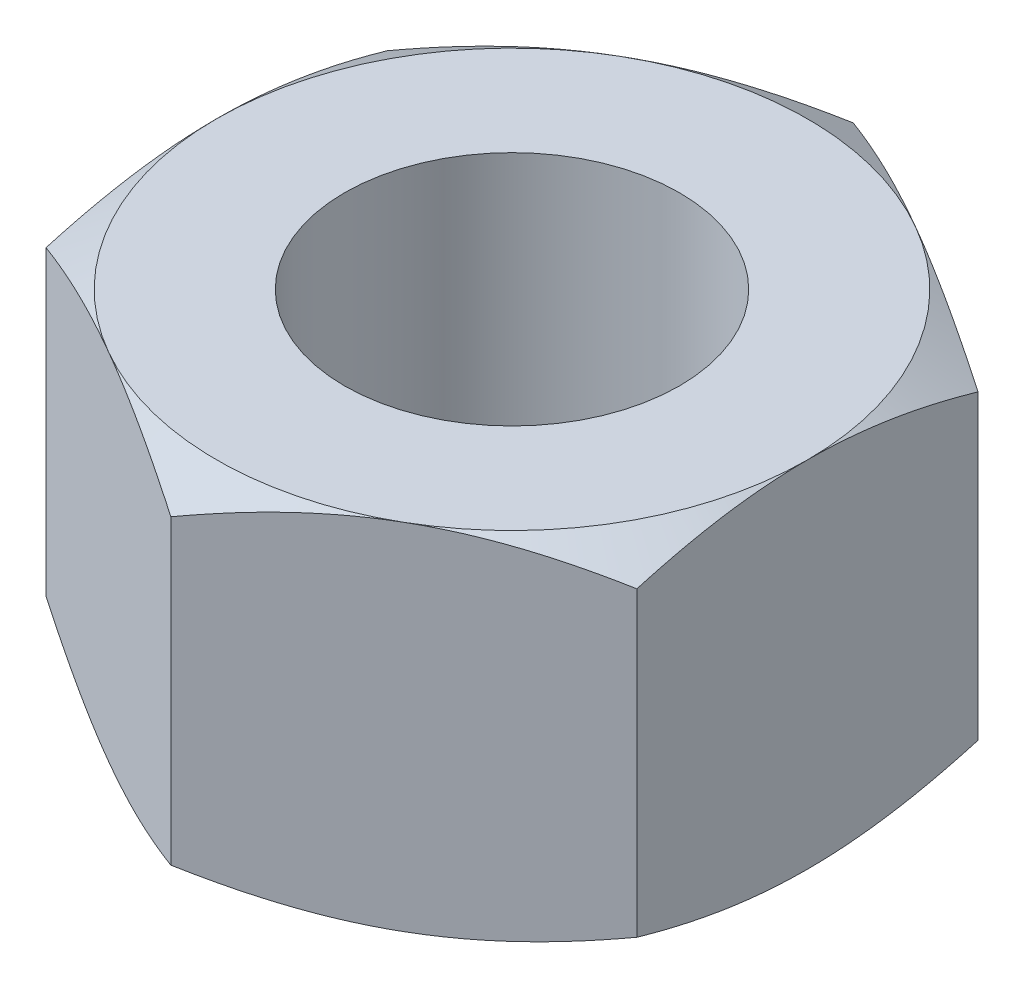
ISO-10303-21;
HEADER;
FILE_DESCRIPTION(('STEP AP214'),'2;1');
FILE_NAME('part.step','',(''),(''),'','','');
FILE_SCHEMA(('AUTOMOTIVE_DESIGN { 1 0 10303 214 1 1 1 1 }'));
ENDSEC;
DATA;
#1=APPLICATION_CONTEXT('core data for automotive mechanical design processes');
#2=APPLICATION_PROTOCOL_DEFINITION('international standard','automotive_design',2000,#1);
#3=PRODUCT_CONTEXT('',#1,'mechanical');
#4=PRODUCT('Part','Part','',(#3));
#5=PRODUCT_RELATED_PRODUCT_CATEGORY('part','',(#4));
#6=PRODUCT_DEFINITION_FORMATION('','',#4);
#7=PRODUCT_DEFINITION_CONTEXT('part definition',#1,'design');
#8=PRODUCT_DEFINITION('design','',#6,#7);
#9=PRODUCT_DEFINITION_SHAPE('','',#8);
#10=(LENGTH_UNIT() NAMED_UNIT(*) SI_UNIT(.MILLI.,.METRE.));
#11=(NAMED_UNIT(*) PLANE_ANGLE_UNIT() SI_UNIT($,.RADIAN.));
#12=(NAMED_UNIT(*) SI_UNIT($,.STERADIAN.) SOLID_ANGLE_UNIT());
#13=UNCERTAINTY_MEASURE_WITH_UNIT(LENGTH_MEASURE(1.E-05),#10,'distance_accuracy_value','');
#14=(GEOMETRIC_REPRESENTATION_CONTEXT(3) GLOBAL_UNCERTAINTY_ASSIGNED_CONTEXT((#13)) GLOBAL_UNIT_ASSIGNED_CONTEXT((#10,
#11,#12)) REPRESENTATION_CONTEXT('',''));
#15=CARTESIAN_POINT('',(0.,0.,0.));
#16=DIRECTION('',(0.,0.,1.));
#17=DIRECTION('',(1.,0.,0.));
#18=AXIS2_PLACEMENT_3D('',#15,#16,#17);
#19=CARTESIAN_POINT('',(9.,5.4,-5.19615242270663));
#20=DIRECTION('',(-0.5,0.,0.866025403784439));
#21=DIRECTION('',(0.866025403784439,0.,0.5));
#22=AXIS2_PLACEMENT_3D('',#19,#20,#21);
#23=PLANE('',#22);
#24=DIRECTION('',(0.,-1.,0.));
#25=VECTOR('',#24,1.);
#26=CARTESIAN_POINT('',(9.,5.4,-5.19615242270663));
#27=LINE('',#26,#25);
#28=CARTESIAN_POINT('',(9.,4.59615242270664,-5.19615242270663));
#29=VERTEX_POINT('',#28);
#30=CARTESIAN_POINT('',(9.,-4.59615242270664,-5.19615242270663));
#31=VERTEX_POINT('',#30);
#32=EDGE_CURVE('E260',#29,#31,#27,.T.);
#33=ORIENTED_EDGE('',*,*,#32,.T.);
#34=CARTESIAN_POINT('',(9.0002,-4.59608575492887,-5.1960369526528));
#35=CARTESIAN_POINT('',(8.80239295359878,-4.66201799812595,-5.31024090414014));
#36=CARTESIAN_POINT('',(8.60381439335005,-4.72495859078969,-5.42489028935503));
#37=CARTESIAN_POINT('',(8.20504463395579,-4.84403100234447,-5.65512011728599));
#38=CARTESIAN_POINT('',(8.00485277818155,-4.90015988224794,-5.77070093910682));
#39=CARTESIAN_POINT('',(7.6024849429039,-5.00484803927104,-6.00300811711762));
#40=CARTESIAN_POINT('',(7.4003054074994,-5.05338922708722,-6.11973652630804));
#41=CARTESIAN_POINT('',(6.99457124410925,-5.14185148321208,-6.35398725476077));
#42=CARTESIAN_POINT('',(6.79101690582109,-5.18177431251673,-6.47150940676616));
#43=CARTESIAN_POINT('',(6.38769409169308,-5.25131532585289,-6.70436794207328));
#44=CARTESIAN_POINT('',(6.18795540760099,-5.2811624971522,-6.81968712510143));
#45=CARTESIAN_POINT('',(5.787584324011,-5.33120669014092,-7.05084147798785));
#46=CARTESIAN_POINT('',(5.58695200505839,-5.35140456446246,-7.16667660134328));
#47=CARTESIAN_POINT('',(5.18533936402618,-5.38164565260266,-7.39854776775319));
#48=CARTESIAN_POINT('',(4.98435969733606,-5.3917003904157,-7.51458343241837));
#49=CARTESIAN_POINT('',(4.58221540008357,-5.40143766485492,-7.74676155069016));
#50=CARTESIAN_POINT('',(4.38105077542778,-5.40112052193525,-7.86290400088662));
#51=CARTESIAN_POINT('',(4.00496738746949,-5.39083604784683,-8.08003584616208));
#52=CARTESIAN_POINT('',(3.83002210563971,-5.3821232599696,-8.18104055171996));
#53=CARTESIAN_POINT('',(3.48054132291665,-5.35702265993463,-8.38281337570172));
#54=CARTESIAN_POINT('',(3.30600585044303,-5.34063433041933,-8.48358147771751));
#55=CARTESIAN_POINT('',(2.78307512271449,-5.28034344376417,-8.7854956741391));
#56=CARTESIAN_POINT('',(2.43560548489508,-5.22532251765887,-8.98610736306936));
#57=CARTESIAN_POINT('',(1.736980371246,-5.08776952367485,-9.38945876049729));
#58=CARTESIAN_POINT('',(1.38591405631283,-5.00465438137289,-9.59214699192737));
#59=CARTESIAN_POINT('',(0.689016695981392,-4.81601746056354,-9.99450087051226));
#60=CARTESIAN_POINT('',(0.343176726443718,-4.71053998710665,-10.1941716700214));
#61=CARTESIAN_POINT('',(-0.000200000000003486,-4.59608575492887,-10.3924203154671));
#62=B_SPLINE_CURVE_WITH_KNOTS('',3,(#34,#35,#36,#37,#38,#39,#40,#41,#42,#43,#44,#45,#46,#47,#48,
#49,#50,#51,#52,#53,#54,#55,#56,#57,#58,#59,#60,#61),.UNSPECIFIED.,.F.,.F.,(4,2,2,2,2,2,2,2,2,2,
2,2,2,4),(0.,0.713219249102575,1.42674513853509,2.14194697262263,2.85700253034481,
3.55449749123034,4.25193080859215,4.94857085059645,5.64518936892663,6.25162976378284,
6.8581110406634,8.07193747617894,9.31268391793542,10.5509947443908),.UNSPECIFIED.);
#63=CARTESIAN_POINT('',(4.5,-5.4,-7.79422863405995));
#64=VERTEX_POINT('',#63);
#65=EDGE_CURVE('E156',#31,#64,#62,.T.);
#66=ORIENTED_EDGE('',*,*,#65,.T.);
#67=CARTESIAN_POINT('',(0.,-4.59615242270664,-10.3923048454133));
#68=VERTEX_POINT('',#67);
#69=EDGE_CURVE('E143',#64,#68,#62,.T.);
#70=ORIENTED_EDGE('',*,*,#69,.T.);
#71=DIRECTION('',(0.,-1.,0.));
#72=VECTOR('',#71,1.);
#73=CARTESIAN_POINT('',(0.,5.4,-10.3923048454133));
#74=LINE('',#73,#72);
#75=CARTESIAN_POINT('',(0.,4.59615242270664,-10.3923048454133));
#76=VERTEX_POINT('',#75);
#77=EDGE_CURVE('E155',#76,#68,#74,.T.);
#78=ORIENTED_EDGE('',*,*,#77,.F.);
#79=CARTESIAN_POINT('',(9.0002,4.59608575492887,-5.1960369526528));
#80=CARTESIAN_POINT('',(8.80239295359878,4.66201799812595,-5.31024090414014));
#81=CARTESIAN_POINT('',(8.60381439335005,4.72495859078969,-5.42489028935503));
#82=CARTESIAN_POINT('',(8.20504463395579,4.84403100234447,-5.65512011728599));
#83=CARTESIAN_POINT('',(8.00485277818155,4.90015988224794,-5.77070093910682));
#84=CARTESIAN_POINT('',(7.6024849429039,5.00484803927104,-6.00300811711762));
#85=CARTESIAN_POINT('',(7.4003054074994,5.05338922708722,-6.11973652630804));
#86=CARTESIAN_POINT('',(6.99457124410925,5.14185148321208,-6.35398725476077));
#87=CARTESIAN_POINT('',(6.79101690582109,5.18177431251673,-6.47150940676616));
#88=CARTESIAN_POINT('',(6.38769409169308,5.25131532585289,-6.70436794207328));
#89=CARTESIAN_POINT('',(6.18795540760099,5.2811624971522,-6.81968712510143));
#90=CARTESIAN_POINT('',(5.787584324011,5.33120669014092,-7.05084147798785));
#91=CARTESIAN_POINT('',(5.58695200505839,5.35140456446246,-7.16667660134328));
#92=CARTESIAN_POINT('',(5.18533936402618,5.38164565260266,-7.39854776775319));
#93=CARTESIAN_POINT('',(4.98435969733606,5.3917003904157,-7.51458343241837));
#94=CARTESIAN_POINT('',(4.58221540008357,5.40143766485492,-7.74676155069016));
#95=CARTESIAN_POINT('',(4.38105077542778,5.40112052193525,-7.86290400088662));
#96=CARTESIAN_POINT('',(4.00496738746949,5.39083604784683,-8.08003584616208));
#97=CARTESIAN_POINT('',(3.83002210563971,5.3821232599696,-8.18104055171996));
#98=CARTESIAN_POINT('',(3.48054132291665,5.35702265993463,-8.38281337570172));
#99=CARTESIAN_POINT('',(3.30600585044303,5.34063433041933,-8.48358147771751));
#100=CARTESIAN_POINT('',(2.78307512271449,5.28034344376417,-8.7854956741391));
#101=CARTESIAN_POINT('',(2.43560548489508,5.22532251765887,-8.98610736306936));
#102=CARTESIAN_POINT('',(1.736980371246,5.08776952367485,-9.38945876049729));
#103=CARTESIAN_POINT('',(1.38591405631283,5.00465438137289,-9.59214699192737));
#104=CARTESIAN_POINT('',(0.689016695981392,4.81601746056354,-9.99450087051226));
#105=CARTESIAN_POINT('',(0.343176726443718,4.71053998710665,-10.1941716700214));
#106=CARTESIAN_POINT('',(-0.000200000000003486,4.59608575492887,-10.3924203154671));
#107=B_SPLINE_CURVE_WITH_KNOTS('',3,(#79,#80,#81,#82,#83,#84,#85,#86,#87,#88,#89,#90,#91,#92,
#93,#94,#95,#96,#97,#98,#99,#100,#101,#102,#103,#104,#105,#106),.UNSPECIFIED.,.F.,.F.,(4,2,2,2,
2,2,2,2,2,2,2,2,2,4),(0.,0.713219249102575,1.42674513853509,2.14194697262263,2.85700253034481,
3.55449749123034,4.25193080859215,4.94857085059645,5.64518936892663,6.25162976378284,
6.8581110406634,8.07193747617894,9.31268391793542,10.5509947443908),.UNSPECIFIED.);
#108=CARTESIAN_POINT('',(4.5,5.4,-7.79422863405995));
#109=VERTEX_POINT('',#108);
#110=EDGE_CURVE('E253',#109,#76,#107,.T.);
#111=ORIENTED_EDGE('',*,*,#110,.F.);
#112=EDGE_CURVE('E259',#29,#109,#107,.T.);
#113=ORIENTED_EDGE('',*,*,#112,.F.);
#114=EDGE_LOOP('',(#33,#66,#70,#78,#111,#113));
#115=FACE_BOUND('',#114,.T.);
#116=ADVANCED_FACE('F36',(#115),#23,.F.);
#117=CARTESIAN_POINT('',(0.,5.4,-10.3923048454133));
#118=DIRECTION('',(0.5,0.,0.866025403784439));
#119=DIRECTION('',(0.866025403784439,0.,-0.5));
#120=AXIS2_PLACEMENT_3D('',#117,#118,#119);
#121=PLANE('',#120);
#122=ORIENTED_EDGE('',*,*,#77,.T.);
#123=CARTESIAN_POINT('',(0.000199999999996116,-4.59608575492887,-10.3924203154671));
#124=CARTESIAN_POINT('',(-0.19760704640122,-4.66201799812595,-10.2782163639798));
#125=CARTESIAN_POINT('',(-0.396185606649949,-4.72495859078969,-10.1635669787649));
#126=CARTESIAN_POINT('',(-0.794955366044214,-4.84403100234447,-9.9333371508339));
#127=CARTESIAN_POINT('',(-0.995147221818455,-4.90015988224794,-9.81775632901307));
#128=CARTESIAN_POINT('',(-1.3975150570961,-5.00484803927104,-9.58544915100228));
#129=CARTESIAN_POINT('',(-1.5996945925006,-5.05338922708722,-9.46872074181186));
#130=CARTESIAN_POINT('',(-2.00542875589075,-5.14185148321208,-9.23447001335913));
#131=CARTESIAN_POINT('',(-2.20898309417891,-5.18177431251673,-9.11694786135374));
#132=CARTESIAN_POINT('',(-2.61230590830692,-5.25131532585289,-8.88408932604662));
#133=CARTESIAN_POINT('',(-2.81204459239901,-5.2811624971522,-8.76877014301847));
#134=CARTESIAN_POINT('',(-3.212415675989,-5.33120669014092,-8.53761579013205));
#135=CARTESIAN_POINT('',(-3.41304799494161,-5.35140456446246,-8.42178066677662));
#136=CARTESIAN_POINT('',(-3.81466063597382,-5.38164565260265,-8.18990950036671));
#137=CARTESIAN_POINT('',(-4.01564030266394,-5.3917003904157,-8.07387383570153));
#138=CARTESIAN_POINT('',(-4.41778459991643,-5.40143766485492,-7.84169571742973));
#139=CARTESIAN_POINT('',(-4.61894922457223,-5.40112052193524,-7.72555326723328));
#140=CARTESIAN_POINT('',(-4.99503261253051,-5.39083604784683,-7.50842142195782));
#141=CARTESIAN_POINT('',(-5.1699778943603,-5.3821232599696,-7.40741671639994));
#142=CARTESIAN_POINT('',(-5.51945867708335,-5.35702265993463,-7.20564389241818));
#143=CARTESIAN_POINT('',(-5.69399414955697,-5.34063433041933,-7.10487579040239));
#144=CARTESIAN_POINT('',(-6.21692487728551,-5.28034344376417,-6.8029615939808));
#145=CARTESIAN_POINT('',(-6.56439451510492,-5.22532251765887,-6.60234990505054));
#146=CARTESIAN_POINT('',(-7.263019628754,-5.08776952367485,-6.19899850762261));
#147=CARTESIAN_POINT('',(-7.61408594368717,-5.00465438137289,-5.99631027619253));
#148=CARTESIAN_POINT('',(-8.31098330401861,-4.81601746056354,-5.59395639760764));
#149=CARTESIAN_POINT('',(-8.65682327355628,-4.71053998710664,-5.39428559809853));
#150=CARTESIAN_POINT('',(-9.0002,-4.59608575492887,-5.1960369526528));
#151=B_SPLINE_CURVE_WITH_KNOTS('',3,(#123,#124,#125,#126,#127,#128,#129,#130,#131,#132,#133,
#134,#135,#136,#137,#138,#139,#140,#141,#142,#143,#144,#145,#146,#147,#148,#149,#150),
.UNSPECIFIED.,.F.,.F.,(4,2,2,2,2,2,2,2,2,2,2,2,2,4),(0.,0.713219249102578,1.42674513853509,
2.14194697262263,2.85700253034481,3.55449749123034,4.25193080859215,4.94857085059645,
5.64518936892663,6.25162976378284,6.85811104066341,8.07193747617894,9.31268391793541,
10.5509947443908),.UNSPECIFIED.);
#152=CARTESIAN_POINT('',(-4.5,-5.4,-7.79422863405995));
#153=VERTEX_POINT('',#152);
#154=EDGE_CURVE('E136',#68,#153,#151,.T.);
#155=ORIENTED_EDGE('',*,*,#154,.T.);
#156=CARTESIAN_POINT('',(-9.,-4.59615242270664,-5.19615242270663));
#157=VERTEX_POINT('',#156);
#158=EDGE_CURVE('E125',#153,#157,#151,.T.);
#159=ORIENTED_EDGE('',*,*,#158,.T.);
#160=DIRECTION('',(0.,-1.,0.));
#161=VECTOR('',#160,1.);
#162=CARTESIAN_POINT('',(-9.,5.4,-5.19615242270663));
#163=LINE('',#162,#161);
#164=CARTESIAN_POINT('',(-9.,4.59615242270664,-5.19615242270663));
#165=VERTEX_POINT('',#164);
#166=EDGE_CURVE('E272',#165,#157,#163,.T.);
#167=ORIENTED_EDGE('',*,*,#166,.F.);
#168=CARTESIAN_POINT('',(0.000199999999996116,4.59608575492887,-10.3924203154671));
#169=CARTESIAN_POINT('',(-0.19760704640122,4.66201799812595,-10.2782163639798));
#170=CARTESIAN_POINT('',(-0.396185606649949,4.72495859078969,-10.1635669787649));
#171=CARTESIAN_POINT('',(-0.794955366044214,4.84403100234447,-9.9333371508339));
#172=CARTESIAN_POINT('',(-0.995147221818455,4.90015988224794,-9.81775632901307));
#173=CARTESIAN_POINT('',(-1.3975150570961,5.00484803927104,-9.58544915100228));
#174=CARTESIAN_POINT('',(-1.5996945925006,5.05338922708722,-9.46872074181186));
#175=CARTESIAN_POINT('',(-2.00542875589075,5.14185148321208,-9.23447001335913));
#176=CARTESIAN_POINT('',(-2.20898309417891,5.18177431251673,-9.11694786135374));
#177=CARTESIAN_POINT('',(-2.61230590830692,5.25131532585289,-8.88408932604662));
#178=CARTESIAN_POINT('',(-2.81204459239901,5.2811624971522,-8.76877014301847));
#179=CARTESIAN_POINT('',(-3.212415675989,5.33120669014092,-8.53761579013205));
#180=CARTESIAN_POINT('',(-3.41304799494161,5.35140456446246,-8.42178066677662));
#181=CARTESIAN_POINT('',(-3.81466063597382,5.38164565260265,-8.18990950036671));
#182=CARTESIAN_POINT('',(-4.01564030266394,5.3917003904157,-8.07387383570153));
#183=CARTESIAN_POINT('',(-4.41778459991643,5.40143766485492,-7.84169571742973));
#184=CARTESIAN_POINT('',(-4.61894922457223,5.40112052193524,-7.72555326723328));
#185=CARTESIAN_POINT('',(-4.99503261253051,5.39083604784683,-7.50842142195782));
#186=CARTESIAN_POINT('',(-5.1699778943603,5.3821232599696,-7.40741671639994));
#187=CARTESIAN_POINT('',(-5.51945867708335,5.35702265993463,-7.20564389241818));
#188=CARTESIAN_POINT('',(-5.69399414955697,5.34063433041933,-7.10487579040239));
#189=CARTESIAN_POINT('',(-6.21692487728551,5.28034344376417,-6.8029615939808));
#190=CARTESIAN_POINT('',(-6.56439451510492,5.22532251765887,-6.60234990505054));
#191=CARTESIAN_POINT('',(-7.263019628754,5.08776952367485,-6.19899850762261));
#192=CARTESIAN_POINT('',(-7.61408594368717,5.00465438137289,-5.99631027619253));
#193=CARTESIAN_POINT('',(-8.31098330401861,4.81601746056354,-5.59395639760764));
#194=CARTESIAN_POINT('',(-8.65682327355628,4.71053998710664,-5.39428559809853));
#195=CARTESIAN_POINT('',(-9.0002,4.59608575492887,-5.1960369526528));
#196=B_SPLINE_CURVE_WITH_KNOTS('',3,(#168,#169,#170,#171,#172,#173,#174,#175,#176,#177,#178,
#179,#180,#181,#182,#183,#184,#185,#186,#187,#188,#189,#190,#191,#192,#193,#194,#195),
.UNSPECIFIED.,.F.,.F.,(4,2,2,2,2,2,2,2,2,2,2,2,2,4),(0.,0.713219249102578,1.42674513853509,
2.14194697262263,2.85700253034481,3.55449749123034,4.25193080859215,4.94857085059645,
5.64518936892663,6.25162976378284,6.85811104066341,8.07193747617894,9.31268391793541,
10.5509947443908),.UNSPECIFIED.);
#197=CARTESIAN_POINT('',(-4.5,5.4,-7.79422863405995));
#198=VERTEX_POINT('',#197);
#199=EDGE_CURVE('E246',#198,#165,#196,.T.);
#200=ORIENTED_EDGE('',*,*,#199,.F.);
#201=EDGE_CURVE('E252',#76,#198,#196,.T.);
#202=ORIENTED_EDGE('',*,*,#201,.F.);
#203=EDGE_LOOP('',(#122,#155,#159,#167,#200,#202));
#204=FACE_BOUND('',#203,.T.);
#205=ADVANCED_FACE('F152',(#204),#121,.F.);
#206=CARTESIAN_POINT('',(-9.,5.4,-5.19615242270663));
#207=DIRECTION('',(1.,0.,0.));
#208=DIRECTION('',(0.,0.,-1.));
#209=AXIS2_PLACEMENT_3D('',#206,#207,#208);
#210=PLANE('',#209);
#211=ORIENTED_EDGE('',*,*,#166,.T.);
#212=CARTESIAN_POINT('',(-9.,-0.985362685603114,-14.0036366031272));
#213=CARTESIAN_POINT('',(-9.,-1.17647922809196,-13.6100361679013));
#214=CARTESIAN_POINT('',(-9.,-1.36577608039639,-13.2155368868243));
#215=CARTESIAN_POINT('',(-9.,-1.73970746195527,-12.4242625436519));
#216=CARTESIAN_POINT('',(-9.,-1.92434126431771,-12.0274871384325));
#217=CARTESIAN_POINT('',(-9.,-2.28884194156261,-11.2291616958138));
#218=CARTESIAN_POINT('',(-9.,-2.46867781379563,-10.8275974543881));
#219=CARTESIAN_POINT('',(-9.,-2.8210475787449,-10.0212898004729));
#220=CARTESIAN_POINT('',(-9.,-2.99358181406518,-9.61654653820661));
#221=CARTESIAN_POINT('',(-9.,-3.33478386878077,-8.79024970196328));
#222=CARTESIAN_POINT('',(-9.,-3.50315251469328,-8.36857190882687));
#223=CARTESIAN_POINT('',(-9.,-3.82725839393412,-7.52030188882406));
#224=CARTESIAN_POINT('',(-9.,-3.98299421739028,-7.09370911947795));
#225=CARTESIAN_POINT('',(-9.,-4.27778132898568,-6.23570761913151));
#226=CARTESIAN_POINT('',(-9.,-4.4168659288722,-5.80431045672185));
#227=CARTESIAN_POINT('',(-9.,-4.6739211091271,-4.93534501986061));
#228=CARTESIAN_POINT('',(-9.,-4.79189828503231,-4.49777871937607));
#229=CARTESIAN_POINT('',(-9.,-5.00050379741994,-3.61846165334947));
#230=CARTESIAN_POINT('',(-9.,-5.09127440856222,-3.17674557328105));
#231=CARTESIAN_POINT('',(-9.,-5.20308975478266,-2.51011384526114));
#232=CARTESIAN_POINT('',(-9.,-5.23630620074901,-2.28721176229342));
#233=CARTESIAN_POINT('',(-9.,-5.29397536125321,-1.84028402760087));
#234=CARTESIAN_POINT('',(-9.,-5.31842892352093,-1.61625848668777));
#235=CARTESIAN_POINT('',(-9.,-5.35777593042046,-1.17033182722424));
#236=CARTESIAN_POINT('',(-9.,-5.37279074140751,-0.948441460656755));
#237=CARTESIAN_POINT('',(-9.,-5.3934212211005,-0.504224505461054));
#238=CARTESIAN_POINT('',(-9.,-5.39903704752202,-0.281897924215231));
#239=CARTESIAN_POINT('',(-9.,-5.40073546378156,0.16279735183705));
#240=CARTESIAN_POINT('',(-9.,-5.39681787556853,0.385166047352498));
#241=CARTESIAN_POINT('',(-9.,-5.37954551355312,0.829539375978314));
#242=CARTESIAN_POINT('',(-9.,-5.36619027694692,1.05154399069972));
#243=CARTESIAN_POINT('',(-9.,-5.32316654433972,1.58348939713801));
#244=CARTESIAN_POINT('',(-9.,-5.28910951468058,1.89308284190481));
#245=CARTESIAN_POINT('',(-9.,-5.20448754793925,2.50998934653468));
#246=CARTESIAN_POINT('',(-9.,-5.15392042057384,2.81730209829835));
#247=CARTESIAN_POINT('',(-9.,-4.98013449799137,3.73543912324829));
#248=CARTESIAN_POINT('',(-9.,-4.83486023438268,4.34214486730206));
#249=CARTESIAN_POINT('',(-9.,-4.58261738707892,5.24980458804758));
#250=CARTESIAN_POINT('',(-9.,-4.49156295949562,5.55545127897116));
#251=CARTESIAN_POINT('',(-9.,-4.2999320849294,6.16377442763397));
#252=CARTESIAN_POINT('',(-9.,-4.19935556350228,6.46645086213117));
#253=CARTESIAN_POINT('',(-9.,-3.99030015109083,7.06893436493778));
#254=CARTESIAN_POINT('',(-9.,-3.88182365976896,7.36874227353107));
#255=CARTESIAN_POINT('',(-9.,-3.65825154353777,7.96586312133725));
#256=CARTESIAN_POINT('',(-9.,-3.54315608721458,8.26317612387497));
#257=CARTESIAN_POINT('',(-9.,-3.21313232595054,9.09267749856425));
#258=CARTESIAN_POINT('',(-9.,-2.99202671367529,9.62240622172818));
#259=CARTESIAN_POINT('',(-9.,-2.53677936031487,10.6762533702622));
#260=CARTESIAN_POINT('',(-9.,-2.3026360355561,11.2003711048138));
#261=CARTESIAN_POINT('',(-9.,-1.82454366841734,12.2443615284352));
#262=CARTESIAN_POINT('',(-9.,-1.580590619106,12.7642323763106));
#263=CARTESIAN_POINT('',(-9.,-1.08533082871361,13.8004179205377));
#264=CARTESIAN_POINT('',(-9.,-0.834024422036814,14.316732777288));
#265=CARTESIAN_POINT('',(-9.,-0.325296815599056,15.3474088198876));
#266=CARTESIAN_POINT('',(-9.,-0.0678660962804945,15.8617652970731));
#267=CARTESIAN_POINT('',(-9.,0.451480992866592,16.8882108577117));
#268=CARTESIAN_POINT('',(-9.,0.713397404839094,17.400299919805));
#269=CARTESIAN_POINT('',(-9.,1.24074237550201,18.4225098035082));
#270=CARTESIAN_POINT('',(-9.,1.50617008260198,18.9326310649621));
#271=CARTESIAN_POINT('',(-9.,2.03992023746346,19.9513577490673));
#272=CARTESIAN_POINT('',(-9.,2.30824269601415,20.4599631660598));
#273=CARTESIAN_POINT('',(-9.,3.05663949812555,21.8706079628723));
#274=CARTESIAN_POINT('',(-9.,3.53925720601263,22.7712976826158));
#275=CARTESIAN_POINT('',(-9.,4.5098695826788,24.5698469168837));
#276=CARTESIAN_POINT('',(-9.,4.99786461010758,25.4677062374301));
#277=CARTESIAN_POINT('',(-9.,5.97617664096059,27.2582026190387));
#278=CARTESIAN_POINT('',(-9.,6.46648014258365,28.1508470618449));
#279=CARTESIAN_POINT('',(-9.,7.20418291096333,29.488525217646));
#280=CARTESIAN_POINT('',(-9.,7.45044831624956,29.9341850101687));
#281=CARTESIAN_POINT('',(-9.,7.94364996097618,30.8251326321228));
#282=CARTESIAN_POINT('',(-9.,8.19058619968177,31.2704204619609));
#283=CARTESIAN_POINT('',(-9.,8.43781567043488,31.7155454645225));
#284=B_SPLINE_CURVE_WITH_KNOTS('',3,(#212,#213,#214,#215,#216,#217,#218,#219,#220,#221,#222,
#223,#224,#225,#226,#227,#228,#229,#230,#231,#232,#233,#234,#235,#236,#237,#238,#239,#240,#241,
#242,#243,#244,#245,#246,#247,#248,#249,#250,#251,#252,#253,#254,#255,#256,#257,#258,#259,#260,
#261,#262,#263,#264,#265,#266,#267,#268,#269,#270,#271,#272,#273,#274,#275,#276,#277,#278,#279,
#280,#281,#282,#283),.UNSPECIFIED.,.F.,.F.,(4,2,2,2,2,2,2,2,2,2,2,2,2,2,2,2,2,2,2,2,2,2,2,2,2,2,
2,2,2,2,2,2,2,2,2,4),(0.,1.31265496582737,2.62551330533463,3.94543724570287,5.26529918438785,
6.62728798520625,7.98942858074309,9.34879690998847,10.7077397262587,12.0594468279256,
12.7353919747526,13.411271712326,14.0782727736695,14.7452626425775,15.4122649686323,
16.0793000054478,17.0131570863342,17.9471381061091,19.8160517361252,20.7727344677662,
21.7294246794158,22.6858254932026,23.6422019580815,25.3639956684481,27.0859989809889,
28.8087129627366,30.5313487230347,32.2568641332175,33.9823957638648,35.7075163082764,
37.4326432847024,40.4981418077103,43.5638460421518,46.6191454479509,48.1466703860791,
49.6741936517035),.UNSPECIFIED.);
#285=CARTESIAN_POINT('',(-9.,-5.4,0.));
#286=VERTEX_POINT('',#285);
#287=EDGE_CURVE('E131',#157,#286,#284,.T.);
#288=ORIENTED_EDGE('',*,*,#287,.T.);
#289=CARTESIAN_POINT('',(-9.,-4.59615242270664,5.19615242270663));
#290=VERTEX_POINT('',#289);
#291=EDGE_CURVE('E52',#286,#290,#284,.T.);
#292=ORIENTED_EDGE('',*,*,#291,.T.);
#293=DIRECTION('',(0.,-1.,0.));
#294=VECTOR('',#293,1.);
#295=CARTESIAN_POINT('',(-9.,5.4,5.19615242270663));
#296=LINE('',#295,#294);
#297=CARTESIAN_POINT('',(-9.,4.59615242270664,5.19615242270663));
#298=VERTEX_POINT('',#297);
#299=EDGE_CURVE('E269',#298,#290,#296,.T.);
#300=ORIENTED_EDGE('',*,*,#299,.F.);
#301=CARTESIAN_POINT('',(-9.,0.985362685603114,-14.0036366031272));
#302=CARTESIAN_POINT('',(-9.,1.17647922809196,-13.6100361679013));
#303=CARTESIAN_POINT('',(-9.,1.36577608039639,-13.2155368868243));
#304=CARTESIAN_POINT('',(-9.,1.73970746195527,-12.4242625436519));
#305=CARTESIAN_POINT('',(-9.,1.92434126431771,-12.0274871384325));
#306=CARTESIAN_POINT('',(-9.,2.28884194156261,-11.2291616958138));
#307=CARTESIAN_POINT('',(-9.,2.46867781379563,-10.8275974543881));
#308=CARTESIAN_POINT('',(-9.,2.8210475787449,-10.0212898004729));
#309=CARTESIAN_POINT('',(-9.,2.99358181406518,-9.61654653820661));
#310=CARTESIAN_POINT('',(-9.,3.33478386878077,-8.79024970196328));
#311=CARTESIAN_POINT('',(-9.,3.50315251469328,-8.36857190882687));
#312=CARTESIAN_POINT('',(-9.,3.82725839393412,-7.52030188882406));
#313=CARTESIAN_POINT('',(-9.,3.98299421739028,-7.09370911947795));
#314=CARTESIAN_POINT('',(-9.,4.27778132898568,-6.23570761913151));
#315=CARTESIAN_POINT('',(-9.,4.4168659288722,-5.80431045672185));
#316=CARTESIAN_POINT('',(-9.,4.6739211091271,-4.93534501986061));
#317=CARTESIAN_POINT('',(-9.,4.79189828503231,-4.49777871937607));
#318=CARTESIAN_POINT('',(-9.,5.00050379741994,-3.61846165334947));
#319=CARTESIAN_POINT('',(-9.,5.09127440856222,-3.17674557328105));
#320=CARTESIAN_POINT('',(-9.,5.20308975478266,-2.51011384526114));
#321=CARTESIAN_POINT('',(-9.,5.23630620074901,-2.28721176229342));
#322=CARTESIAN_POINT('',(-9.,5.29397536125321,-1.84028402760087));
#323=CARTESIAN_POINT('',(-9.,5.31842892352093,-1.61625848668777));
#324=CARTESIAN_POINT('',(-9.,5.35777593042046,-1.17033182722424));
#325=CARTESIAN_POINT('',(-9.,5.37279074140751,-0.948441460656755));
#326=CARTESIAN_POINT('',(-9.,5.3934212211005,-0.504224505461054));
#327=CARTESIAN_POINT('',(-9.,5.39903704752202,-0.281897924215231));
#328=CARTESIAN_POINT('',(-9.,5.40073546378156,0.16279735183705));
#329=CARTESIAN_POINT('',(-9.,5.39681787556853,0.385166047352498));
#330=CARTESIAN_POINT('',(-9.,5.37954551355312,0.829539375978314));
#331=CARTESIAN_POINT('',(-9.,5.36619027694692,1.05154399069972));
#332=CARTESIAN_POINT('',(-9.,5.32316654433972,1.58348939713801));
#333=CARTESIAN_POINT('',(-9.,5.28910951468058,1.89308284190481));
#334=CARTESIAN_POINT('',(-9.,5.20448754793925,2.50998934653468));
#335=CARTESIAN_POINT('',(-9.,5.15392042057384,2.81730209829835));
#336=CARTESIAN_POINT('',(-9.,4.98013449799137,3.73543912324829));
#337=CARTESIAN_POINT('',(-9.,4.83486023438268,4.34214486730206));
#338=CARTESIAN_POINT('',(-9.,4.58261738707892,5.24980458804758));
#339=CARTESIAN_POINT('',(-9.,4.49156295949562,5.55545127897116));
#340=CARTESIAN_POINT('',(-9.,4.2999320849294,6.16377442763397));
#341=CARTESIAN_POINT('',(-9.,4.19935556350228,6.46645086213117));
#342=CARTESIAN_POINT('',(-9.,3.99030015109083,7.06893436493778));
#343=CARTESIAN_POINT('',(-9.,3.88182365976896,7.36874227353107));
#344=CARTESIAN_POINT('',(-9.,3.65825154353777,7.96586312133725));
#345=CARTESIAN_POINT('',(-9.,3.54315608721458,8.26317612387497));
#346=CARTESIAN_POINT('',(-9.,3.21313232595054,9.09267749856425));
#347=CARTESIAN_POINT('',(-9.,2.99202671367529,9.62240622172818));
#348=CARTESIAN_POINT('',(-9.,2.53677936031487,10.6762533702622));
#349=CARTESIAN_POINT('',(-9.,2.3026360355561,11.2003711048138));
#350=CARTESIAN_POINT('',(-9.,1.82454366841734,12.2443615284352));
#351=CARTESIAN_POINT('',(-9.,1.580590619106,12.7642323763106));
#352=CARTESIAN_POINT('',(-9.,1.08533082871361,13.8004179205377));
#353=CARTESIAN_POINT('',(-9.,0.834024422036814,14.316732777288));
#354=CARTESIAN_POINT('',(-9.,0.325296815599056,15.3474088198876));
#355=CARTESIAN_POINT('',(-9.,0.0678660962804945,15.8617652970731));
#356=CARTESIAN_POINT('',(-9.,-0.451480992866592,16.8882108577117));
#357=CARTESIAN_POINT('',(-9.,-0.713397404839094,17.400299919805));
#358=CARTESIAN_POINT('',(-9.,-1.24074237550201,18.4225098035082));
#359=CARTESIAN_POINT('',(-9.,-1.50617008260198,18.9326310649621));
#360=CARTESIAN_POINT('',(-9.,-2.03992023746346,19.9513577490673));
#361=CARTESIAN_POINT('',(-9.,-2.30824269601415,20.4599631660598));
#362=CARTESIAN_POINT('',(-9.,-3.05663949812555,21.8706079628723));
#363=CARTESIAN_POINT('',(-9.,-3.53925720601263,22.7712976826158));
#364=CARTESIAN_POINT('',(-9.,-4.5098695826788,24.5698469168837));
#365=CARTESIAN_POINT('',(-9.,-4.99786461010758,25.4677062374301));
#366=CARTESIAN_POINT('',(-9.,-5.97617664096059,27.2582026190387));
#367=CARTESIAN_POINT('',(-9.,-6.46648014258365,28.1508470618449));
#368=CARTESIAN_POINT('',(-9.,-7.20418291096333,29.488525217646));
#369=CARTESIAN_POINT('',(-9.,-7.45044831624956,29.9341850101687));
#370=CARTESIAN_POINT('',(-9.,-7.94364996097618,30.8251326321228));
#371=CARTESIAN_POINT('',(-9.,-8.19058619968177,31.2704204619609));
#372=CARTESIAN_POINT('',(-9.,-8.43781567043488,31.7155454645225));
#373=B_SPLINE_CURVE_WITH_KNOTS('',3,(#301,#302,#303,#304,#305,#306,#307,#308,#309,#310,#311,
#312,#313,#314,#315,#316,#317,#318,#319,#320,#321,#322,#323,#324,#325,#326,#327,#328,#329,#330,
#331,#332,#333,#334,#335,#336,#337,#338,#339,#340,#341,#342,#343,#344,#345,#346,#347,#348,#349,
#350,#351,#352,#353,#354,#355,#356,#357,#358,#359,#360,#361,#362,#363,#364,#365,#366,#367,#368,
#369,#370,#371,#372),.UNSPECIFIED.,.F.,.F.,(4,2,2,2,2,2,2,2,2,2,2,2,2,2,2,2,2,2,2,2,2,2,2,2,2,2,
2,2,2,2,2,2,2,2,2,4),(0.,1.31265496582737,2.62551330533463,3.94543724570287,5.26529918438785,
6.62728798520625,7.98942858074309,9.34879690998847,10.7077397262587,12.0594468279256,
12.7353919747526,13.411271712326,14.0782727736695,14.7452626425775,15.4122649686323,
16.0793000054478,17.0131570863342,17.9471381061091,19.8160517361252,20.7727344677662,
21.7294246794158,22.6858254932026,23.6422019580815,25.3639956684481,27.0859989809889,
28.8087129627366,30.5313487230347,32.2568641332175,33.9823957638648,35.7075163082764,
37.4326432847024,40.4981418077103,43.5638460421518,46.6191454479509,48.1466703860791,
49.6741936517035),.UNSPECIFIED.);
#374=CARTESIAN_POINT('',(-9.,5.4,0.));
#375=VERTEX_POINT('',#374);
#376=EDGE_CURVE('E239',#375,#298,#373,.T.);
#377=ORIENTED_EDGE('',*,*,#376,.F.);
#378=EDGE_CURVE('E245',#165,#375,#373,.T.);
#379=ORIENTED_EDGE('',*,*,#378,.F.);
#380=EDGE_LOOP('',(#211,#288,#292,#300,#377,#379));
#381=FACE_BOUND('',#380,.T.);
#382=ADVANCED_FACE('F218',(#381),#210,.F.);
#383=CARTESIAN_POINT('',(-9.,5.4,5.19615242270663));
#384=DIRECTION('',(0.5,0.,-0.866025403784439));
#385=DIRECTION('',(-0.866025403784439,0.,-0.5));
#386=AXIS2_PLACEMENT_3D('',#383,#384,#385);
#387=PLANE('',#386);
#388=ORIENTED_EDGE('',*,*,#299,.T.);
#389=CARTESIAN_POINT('',(-9.0002,-4.59608575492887,5.1960369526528));
#390=CARTESIAN_POINT('',(-8.80239295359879,-4.66201799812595,5.31024090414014));
#391=CARTESIAN_POINT('',(-8.60381439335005,-4.72495859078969,5.42489028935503));
#392=CARTESIAN_POINT('',(-8.20504463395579,-4.84403100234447,5.655120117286));
#393=CARTESIAN_POINT('',(-8.00485277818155,-4.90015988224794,5.77070093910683));
#394=CARTESIAN_POINT('',(-7.6024849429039,-5.00484803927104,6.00300811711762));
#395=CARTESIAN_POINT('',(-7.4003054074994,-5.05338922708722,6.11973652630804));
#396=CARTESIAN_POINT('',(-6.99457124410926,-5.14185148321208,6.35398725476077));
#397=CARTESIAN_POINT('',(-6.79101690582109,-5.18177431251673,6.47150940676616));
#398=CARTESIAN_POINT('',(-6.38769409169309,-5.25131532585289,6.70436794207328));
#399=CARTESIAN_POINT('',(-6.187955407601,-5.2811624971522,6.81968712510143));
#400=CARTESIAN_POINT('',(-5.787584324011,-5.33120669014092,7.05084147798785));
#401=CARTESIAN_POINT('',(-5.58695200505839,-5.35140456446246,7.16667660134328));
#402=CARTESIAN_POINT('',(-5.18533936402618,-5.38164565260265,7.39854776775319));
#403=CARTESIAN_POINT('',(-4.98435969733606,-5.3917003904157,7.51458343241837));
#404=CARTESIAN_POINT('',(-4.58221540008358,-5.40143766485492,7.74676155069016));
#405=CARTESIAN_POINT('',(-4.38105077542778,-5.40112052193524,7.86290400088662));
#406=CARTESIAN_POINT('',(-4.0049673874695,-5.39083604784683,8.08003584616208));
#407=CARTESIAN_POINT('',(-3.83002210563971,-5.3821232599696,8.18104055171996));
#408=CARTESIAN_POINT('',(-3.48054132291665,-5.35702265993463,8.38281337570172));
#409=CARTESIAN_POINT('',(-3.30600585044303,-5.34063433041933,8.48358147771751));
#410=CARTESIAN_POINT('',(-2.7830751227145,-5.28034344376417,8.7854956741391));
#411=CARTESIAN_POINT('',(-2.43560548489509,-5.22532251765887,8.98610736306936));
#412=CARTESIAN_POINT('',(-1.736980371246,-5.08776952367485,9.38945876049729));
#413=CARTESIAN_POINT('',(-1.38591405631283,-5.00465438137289,9.59214699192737));
#414=CARTESIAN_POINT('',(-0.689016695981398,-4.81601746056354,9.99450087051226));
#415=CARTESIAN_POINT('',(-0.343176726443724,-4.71053998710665,10.1941716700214));
#416=CARTESIAN_POINT('',(0.000199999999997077,-4.59608575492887,10.3924203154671));
#417=B_SPLINE_CURVE_WITH_KNOTS('',3,(#389,#390,#391,#392,#393,#394,#395,#396,#397,#398,#399,
#400,#401,#402,#403,#404,#405,#406,#407,#408,#409,#410,#411,#412,#413,#414,#415,#416),
.UNSPECIFIED.,.F.,.F.,(4,2,2,2,2,2,2,2,2,2,2,2,2,4),(0.,0.713219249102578,1.42674513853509,
2.14194697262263,2.85700253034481,3.55449749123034,4.25193080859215,4.94857085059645,
5.64518936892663,6.25162976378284,6.85811104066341,8.07193747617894,9.31268391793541,
10.5509947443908),.UNSPECIFIED.);
#418=CARTESIAN_POINT('',(-4.5,-5.4,7.79422863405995));
#419=VERTEX_POINT('',#418);
#420=EDGE_CURVE('E212',#290,#419,#417,.T.);
#421=ORIENTED_EDGE('',*,*,#420,.T.);
#422=CARTESIAN_POINT('',(0.,-4.59615242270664,10.3923048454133));
#423=VERTEX_POINT('',#422);
#424=EDGE_CURVE('E59',#419,#423,#417,.T.);
#425=ORIENTED_EDGE('',*,*,#424,.T.);
#426=DIRECTION('',(0.,-1.,0.));
#427=VECTOR('',#426,1.);
#428=CARTESIAN_POINT('',(0.,5.4,10.3923048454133));
#429=LINE('',#428,#427);
#430=CARTESIAN_POINT('',(0.,4.59615242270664,10.3923048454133));
#431=VERTEX_POINT('',#430);
#432=EDGE_CURVE('E266',#431,#423,#429,.T.);
#433=ORIENTED_EDGE('',*,*,#432,.F.);
#434=CARTESIAN_POINT('',(-9.0002,4.59608575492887,5.1960369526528));
#435=CARTESIAN_POINT('',(-8.80239295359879,4.66201799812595,5.31024090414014));
#436=CARTESIAN_POINT('',(-8.60381439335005,4.72495859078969,5.42489028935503));
#437=CARTESIAN_POINT('',(-8.20504463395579,4.84403100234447,5.655120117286));
#438=CARTESIAN_POINT('',(-8.00485277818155,4.90015988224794,5.77070093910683));
#439=CARTESIAN_POINT('',(-7.6024849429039,5.00484803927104,6.00300811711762));
#440=CARTESIAN_POINT('',(-7.4003054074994,5.05338922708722,6.11973652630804));
#441=CARTESIAN_POINT('',(-6.99457124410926,5.14185148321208,6.35398725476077));
#442=CARTESIAN_POINT('',(-6.79101690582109,5.18177431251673,6.47150940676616));
#443=CARTESIAN_POINT('',(-6.38769409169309,5.25131532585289,6.70436794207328));
#444=CARTESIAN_POINT('',(-6.187955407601,5.2811624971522,6.81968712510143));
#445=CARTESIAN_POINT('',(-5.787584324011,5.33120669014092,7.05084147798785));
#446=CARTESIAN_POINT('',(-5.58695200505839,5.35140456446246,7.16667660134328));
#447=CARTESIAN_POINT('',(-5.18533936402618,5.38164565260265,7.39854776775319));
#448=CARTESIAN_POINT('',(-4.98435969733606,5.3917003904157,7.51458343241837));
#449=CARTESIAN_POINT('',(-4.58221540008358,5.40143766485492,7.74676155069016));
#450=CARTESIAN_POINT('',(-4.38105077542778,5.40112052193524,7.86290400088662));
#451=CARTESIAN_POINT('',(-4.0049673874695,5.39083604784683,8.08003584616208));
#452=CARTESIAN_POINT('',(-3.83002210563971,5.3821232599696,8.18104055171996));
#453=CARTESIAN_POINT('',(-3.48054132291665,5.35702265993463,8.38281337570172));
#454=CARTESIAN_POINT('',(-3.30600585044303,5.34063433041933,8.48358147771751));
#455=CARTESIAN_POINT('',(-2.7830751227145,5.28034344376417,8.7854956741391));
#456=CARTESIAN_POINT('',(-2.43560548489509,5.22532251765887,8.98610736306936));
#457=CARTESIAN_POINT('',(-1.736980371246,5.08776952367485,9.38945876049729));
#458=CARTESIAN_POINT('',(-1.38591405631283,5.00465438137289,9.59214699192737));
#459=CARTESIAN_POINT('',(-0.689016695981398,4.81601746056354,9.99450087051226));
#460=CARTESIAN_POINT('',(-0.343176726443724,4.71053998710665,10.1941716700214));
#461=CARTESIAN_POINT('',(0.000199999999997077,4.59608575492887,10.3924203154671));
#462=B_SPLINE_CURVE_WITH_KNOTS('',3,(#434,#435,#436,#437,#438,#439,#440,#441,#442,#443,#444,
#445,#446,#447,#448,#449,#450,#451,#452,#453,#454,#455,#456,#457,#458,#459,#460,#461),
.UNSPECIFIED.,.F.,.F.,(4,2,2,2,2,2,2,2,2,2,2,2,2,4),(0.,0.713219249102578,1.42674513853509,
2.14194697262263,2.85700253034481,3.55449749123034,4.25193080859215,4.94857085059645,
5.64518936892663,6.25162976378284,6.85811104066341,8.07193747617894,9.31268391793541,
10.5509947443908),.UNSPECIFIED.);
#463=CARTESIAN_POINT('',(-4.5,5.4,7.79422863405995));
#464=VERTEX_POINT('',#463);
#465=EDGE_CURVE('E224',#464,#431,#462,.T.);
#466=ORIENTED_EDGE('',*,*,#465,.F.);
#467=EDGE_CURVE('E231',#298,#464,#462,.T.);
#468=ORIENTED_EDGE('',*,*,#467,.F.);
#469=EDGE_LOOP('',(#388,#421,#425,#433,#466,#468));
#470=FACE_BOUND('',#469,.T.);
#471=ADVANCED_FACE('F214',(#470),#387,.F.);
#472=CARTESIAN_POINT('',(0.,5.4,10.3923048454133));
#473=DIRECTION('',(-0.5,0.,-0.866025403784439));
#474=DIRECTION('',(-0.866025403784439,0.,0.5));
#475=AXIS2_PLACEMENT_3D('',#472,#473,#474);
#476=PLANE('',#475);
#477=ORIENTED_EDGE('',*,*,#432,.T.);
#478=CARTESIAN_POINT('',(-0.000200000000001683,-4.59608575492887,10.3924203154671));
#479=CARTESIAN_POINT('',(0.197607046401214,-4.66201799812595,10.2782163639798));
#480=CARTESIAN_POINT('',(0.396185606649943,-4.72495859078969,10.1635669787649));
#481=CARTESIAN_POINT('',(0.794955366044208,-4.84403100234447,9.9333371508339));
#482=CARTESIAN_POINT('',(0.995147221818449,-4.90015988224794,9.81775632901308));
#483=CARTESIAN_POINT('',(1.3975150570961,-5.00484803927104,9.58544915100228));
#484=CARTESIAN_POINT('',(1.5996945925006,-5.05338922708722,9.46872074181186));
#485=CARTESIAN_POINT('',(2.00542875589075,-5.14185148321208,9.23447001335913));
#486=CARTESIAN_POINT('',(2.20898309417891,-5.18177431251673,9.11694786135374));
#487=CARTESIAN_POINT('',(2.61230590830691,-5.25131532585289,8.88408932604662));
#488=CARTESIAN_POINT('',(2.812044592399,-5.2811624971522,8.76877014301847));
#489=CARTESIAN_POINT('',(3.212415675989,-5.33120669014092,8.53761579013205));
#490=CARTESIAN_POINT('',(3.41304799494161,-5.35140456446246,8.42178066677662));
#491=CARTESIAN_POINT('',(3.81466063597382,-5.38164565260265,8.18990950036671));
#492=CARTESIAN_POINT('',(4.01564030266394,-5.3917003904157,8.07387383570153));
#493=CARTESIAN_POINT('',(4.41778459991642,-5.40143766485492,7.84169571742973));
#494=CARTESIAN_POINT('',(4.61894922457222,-5.40112052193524,7.72555326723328));
#495=CARTESIAN_POINT('',(4.9950326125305,-5.39083604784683,7.50842142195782));
#496=CARTESIAN_POINT('',(5.16997789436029,-5.3821232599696,7.40741671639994));
#497=CARTESIAN_POINT('',(5.51945867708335,-5.35702265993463,7.20564389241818));
#498=CARTESIAN_POINT('',(5.69399414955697,-5.34063433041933,7.1048757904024));
#499=CARTESIAN_POINT('',(6.2169248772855,-5.28034344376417,6.8029615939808));
#500=CARTESIAN_POINT('',(6.56439451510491,-5.22532251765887,6.60234990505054));
#501=CARTESIAN_POINT('',(7.263019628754,-5.08776952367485,6.19899850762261));
#502=CARTESIAN_POINT('',(7.61408594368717,-5.00465438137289,5.99631027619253));
#503=CARTESIAN_POINT('',(8.3109833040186,-4.81601746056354,5.59395639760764));
#504=CARTESIAN_POINT('',(8.65682327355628,-4.71053998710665,5.39428559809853));
#505=CARTESIAN_POINT('',(9.0002,-4.59608575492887,5.1960369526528));
#506=B_SPLINE_CURVE_WITH_KNOTS('',3,(#478,#479,#480,#481,#482,#483,#484,#485,#486,#487,#488,
#489,#490,#491,#492,#493,#494,#495,#496,#497,#498,#499,#500,#501,#502,#503,#504,#505),
.UNSPECIFIED.,.F.,.F.,(4,2,2,2,2,2,2,2,2,2,2,2,2,4),(0.,0.713219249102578,1.42674513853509,
2.14194697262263,2.85700253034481,3.55449749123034,4.25193080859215,4.94857085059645,
5.64518936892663,6.25162976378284,6.85811104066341,8.07193747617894,9.31268391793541,
10.5509947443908),.UNSPECIFIED.);
#507=CARTESIAN_POINT('',(4.5,-5.4,7.79422863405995));
#508=VERTEX_POINT('',#507);
#509=EDGE_CURVE('E213',#423,#508,#506,.T.);
#510=ORIENTED_EDGE('',*,*,#509,.T.);
#511=CARTESIAN_POINT('',(9.,-4.59615242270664,5.19615242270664));
#512=VERTEX_POINT('',#511);
#513=EDGE_CURVE('E201',#508,#512,#506,.T.);
#514=ORIENTED_EDGE('',*,*,#513,.T.);
#515=DIRECTION('',(0.,-1.,0.));
#516=VECTOR('',#515,1.);
#517=CARTESIAN_POINT('',(9.,5.4,5.19615242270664));
#518=LINE('',#517,#516);
#519=CARTESIAN_POINT('',(9.,4.59615242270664,5.19615242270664));
#520=VERTEX_POINT('',#519);
#521=EDGE_CURVE('E263',#520,#512,#518,.T.);
#522=ORIENTED_EDGE('',*,*,#521,.F.);
#523=CARTESIAN_POINT('',(-0.000200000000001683,4.59608575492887,10.3924203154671));
#524=CARTESIAN_POINT('',(0.197607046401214,4.66201799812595,10.2782163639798));
#525=CARTESIAN_POINT('',(0.396185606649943,4.72495859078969,10.1635669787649));
#526=CARTESIAN_POINT('',(0.794955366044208,4.84403100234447,9.9333371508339));
#527=CARTESIAN_POINT('',(0.995147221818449,4.90015988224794,9.81775632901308));
#528=CARTESIAN_POINT('',(1.3975150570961,5.00484803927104,9.58544915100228));
#529=CARTESIAN_POINT('',(1.5996945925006,5.05338922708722,9.46872074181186));
#530=CARTESIAN_POINT('',(2.00542875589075,5.14185148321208,9.23447001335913));
#531=CARTESIAN_POINT('',(2.20898309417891,5.18177431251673,9.11694786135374));
#532=CARTESIAN_POINT('',(2.61230590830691,5.25131532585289,8.88408932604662));
#533=CARTESIAN_POINT('',(2.812044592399,5.2811624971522,8.76877014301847));
#534=CARTESIAN_POINT('',(3.212415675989,5.33120669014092,8.53761579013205));
#535=CARTESIAN_POINT('',(3.41304799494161,5.35140456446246,8.42178066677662));
#536=CARTESIAN_POINT('',(3.81466063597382,5.38164565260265,8.18990950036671));
#537=CARTESIAN_POINT('',(4.01564030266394,5.3917003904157,8.07387383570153));
#538=CARTESIAN_POINT('',(4.41778459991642,5.40143766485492,7.84169571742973));
#539=CARTESIAN_POINT('',(4.61894922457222,5.40112052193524,7.72555326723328));
#540=CARTESIAN_POINT('',(4.9950326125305,5.39083604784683,7.50842142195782));
#541=CARTESIAN_POINT('',(5.16997789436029,5.3821232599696,7.40741671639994));
#542=CARTESIAN_POINT('',(5.51945867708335,5.35702265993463,7.20564389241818));
#543=CARTESIAN_POINT('',(5.69399414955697,5.34063433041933,7.1048757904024));
#544=CARTESIAN_POINT('',(6.2169248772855,5.28034344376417,6.8029615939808));
#545=CARTESIAN_POINT('',(6.56439451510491,5.22532251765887,6.60234990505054));
#546=CARTESIAN_POINT('',(7.263019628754,5.08776952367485,6.19899850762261));
#547=CARTESIAN_POINT('',(7.61408594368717,5.00465438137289,5.99631027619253));
#548=CARTESIAN_POINT('',(8.3109833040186,4.81601746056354,5.59395639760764));
#549=CARTESIAN_POINT('',(8.65682327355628,4.71053998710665,5.39428559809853));
#550=CARTESIAN_POINT('',(9.0002,4.59608575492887,5.1960369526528));
#551=B_SPLINE_CURVE_WITH_KNOTS('',3,(#523,#524,#525,#526,#527,#528,#529,#530,#531,#532,#533,
#534,#535,#536,#537,#538,#539,#540,#541,#542,#543,#544,#545,#546,#547,#548,#549,#550),
.UNSPECIFIED.,.F.,.F.,(4,2,2,2,2,2,2,2,2,2,2,2,2,4),(0.,0.713219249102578,1.42674513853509,
2.14194697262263,2.85700253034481,3.55449749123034,4.25193080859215,4.94857085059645,
5.64518936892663,6.25162976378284,6.85811104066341,8.07193747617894,9.31268391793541,
10.5509947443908),.UNSPECIFIED.);
#552=CARTESIAN_POINT('',(4.5,5.4,7.79422863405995));
#553=VERTEX_POINT('',#552);
#554=EDGE_CURVE('E233',#553,#520,#551,.T.);
#555=ORIENTED_EDGE('',*,*,#554,.F.);
#556=EDGE_CURVE('E232',#431,#553,#551,.T.);
#557=ORIENTED_EDGE('',*,*,#556,.F.);
#558=EDGE_LOOP('',(#477,#510,#514,#522,#555,#557));
#559=FACE_BOUND('',#558,.T.);
#560=ADVANCED_FACE('F217',(#559),#476,.F.);
#561=CARTESIAN_POINT('',(9.,5.4,5.19615242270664));
#562=DIRECTION('',(-1.,0.,0.));
#563=DIRECTION('',(0.,0.,1.));
#564=AXIS2_PLACEMENT_3D('',#561,#562,#563);
#565=PLANE('',#564);
#566=ORIENTED_EDGE('',*,*,#521,.T.);
#567=CARTESIAN_POINT('',(9.,-0.985362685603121,-14.0036366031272));
#568=CARTESIAN_POINT('',(9.,-1.17647922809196,-13.6100361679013));
#569=CARTESIAN_POINT('',(9.,-1.36577608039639,-13.2155368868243));
#570=CARTESIAN_POINT('',(9.,-1.73970746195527,-12.4242625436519));
#571=CARTESIAN_POINT('',(9.,-1.92434126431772,-12.0274871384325));
#572=CARTESIAN_POINT('',(9.,-2.28884194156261,-11.2291616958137));
#573=CARTESIAN_POINT('',(9.,-2.46867781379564,-10.8275974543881));
#574=CARTESIAN_POINT('',(9.,-2.82104757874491,-10.0212898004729));
#575=CARTESIAN_POINT('',(9.,-2.99358181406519,-9.6165465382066));
#576=CARTESIAN_POINT('',(9.,-3.33478386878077,-8.79024970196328));
#577=CARTESIAN_POINT('',(9.,-3.50315251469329,-8.36857190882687));
#578=CARTESIAN_POINT('',(9.,-3.82725839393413,-7.52030188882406));
#579=CARTESIAN_POINT('',(9.,-3.98299421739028,-7.09370911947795));
#580=CARTESIAN_POINT('',(9.,-4.27778132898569,-6.23570761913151));
#581=CARTESIAN_POINT('',(9.,-4.4168659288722,-5.80431045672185));
#582=CARTESIAN_POINT('',(9.,-4.6739211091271,-4.93534501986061));
#583=CARTESIAN_POINT('',(9.,-4.79189828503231,-4.49777871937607));
#584=CARTESIAN_POINT('',(9.,-5.00050379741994,-3.61846165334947));
#585=CARTESIAN_POINT('',(9.,-5.09127440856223,-3.17674557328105));
#586=CARTESIAN_POINT('',(9.,-5.20308975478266,-2.51011384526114));
#587=CARTESIAN_POINT('',(9.,-5.23630620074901,-2.28721176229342));
#588=CARTESIAN_POINT('',(9.,-5.29397536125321,-1.84028402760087));
#589=CARTESIAN_POINT('',(9.,-5.31842892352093,-1.61625848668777));
#590=CARTESIAN_POINT('',(9.,-5.35777593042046,-1.17033182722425));
#591=CARTESIAN_POINT('',(9.,-5.37279074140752,-0.948441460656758));
#592=CARTESIAN_POINT('',(9.,-5.3934212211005,-0.504224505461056));
#593=CARTESIAN_POINT('',(9.,-5.39903704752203,-0.281897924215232));
#594=CARTESIAN_POINT('',(9.,-5.40073546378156,0.162797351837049));
#595=CARTESIAN_POINT('',(9.,-5.39681787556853,0.385166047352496));
#596=CARTESIAN_POINT('',(9.,-5.37954551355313,0.829539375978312));
#597=CARTESIAN_POINT('',(9.,-5.36619027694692,1.05154399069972));
#598=CARTESIAN_POINT('',(9.,-5.32316654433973,1.58348939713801));
#599=CARTESIAN_POINT('',(9.,-5.28910951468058,1.8930828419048));
#600=CARTESIAN_POINT('',(9.,-5.20448754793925,2.50998934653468));
#601=CARTESIAN_POINT('',(9.,-5.15392042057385,2.81730209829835));
#602=CARTESIAN_POINT('',(9.,-4.98013449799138,3.73543912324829));
#603=CARTESIAN_POINT('',(9.,-4.83486023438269,4.34214486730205));
#604=CARTESIAN_POINT('',(9.,-4.58261738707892,5.24980458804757));
#605=CARTESIAN_POINT('',(9.,-4.49156295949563,5.55545127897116));
#606=CARTESIAN_POINT('',(9.,-4.2999320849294,6.16377442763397));
#607=CARTESIAN_POINT('',(9.,-4.19935556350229,6.46645086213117));
#608=CARTESIAN_POINT('',(9.,-3.99030015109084,7.06893436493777));
#609=CARTESIAN_POINT('',(9.,-3.88182365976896,7.36874227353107));
#610=CARTESIAN_POINT('',(9.,-3.65825154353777,7.96586312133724));
#611=CARTESIAN_POINT('',(9.,-3.54315608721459,8.26317612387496));
#612=CARTESIAN_POINT('',(9.,-3.21313232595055,9.09267749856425));
#613=CARTESIAN_POINT('',(9.,-2.9920267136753,9.62240622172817));
#614=CARTESIAN_POINT('',(9.,-2.53677936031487,10.6762533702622));
#615=CARTESIAN_POINT('',(9.,-2.30263603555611,11.2003711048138));
#616=CARTESIAN_POINT('',(9.,-1.82454366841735,12.2443615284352));
#617=CARTESIAN_POINT('',(9.,-1.58059061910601,12.7642323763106));
#618=CARTESIAN_POINT('',(9.,-1.08533082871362,13.8004179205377));
#619=CARTESIAN_POINT('',(9.,-0.834024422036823,14.316732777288));
#620=CARTESIAN_POINT('',(9.,-0.325296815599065,15.3474088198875));
#621=CARTESIAN_POINT('',(9.,-0.0678660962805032,15.8617652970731));
#622=CARTESIAN_POINT('',(9.,0.451480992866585,16.8882108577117));
#623=CARTESIAN_POINT('',(9.,0.713397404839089,17.400299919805));
#624=CARTESIAN_POINT('',(9.,1.24074237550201,18.4225098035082));
#625=CARTESIAN_POINT('',(9.,1.50617008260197,18.9326310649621));
#626=CARTESIAN_POINT('',(9.,2.03992023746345,19.9513577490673));
#627=CARTESIAN_POINT('',(9.,2.30824269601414,20.4599631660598));
#628=CARTESIAN_POINT('',(9.,3.05663949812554,21.8706079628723));
#629=CARTESIAN_POINT('',(9.,3.53925720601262,22.7712976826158));
#630=CARTESIAN_POINT('',(9.,4.5098695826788,24.5698469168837));
#631=CARTESIAN_POINT('',(9.,4.99786461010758,25.4677062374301));
#632=CARTESIAN_POINT('',(9.,5.97617664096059,27.2582026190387));
#633=CARTESIAN_POINT('',(9.,6.46648014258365,28.1508470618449));
#634=CARTESIAN_POINT('',(9.,7.20418291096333,29.488525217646));
#635=CARTESIAN_POINT('',(9.,7.45044831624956,29.9341850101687));
#636=CARTESIAN_POINT('',(9.,7.94364996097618,30.8251326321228));
#637=CARTESIAN_POINT('',(9.,8.19058619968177,31.2704204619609));
#638=CARTESIAN_POINT('',(9.,8.43781567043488,31.7155454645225));
#639=B_SPLINE_CURVE_WITH_KNOTS('',3,(#567,#568,#569,#570,#571,#572,#573,#574,#575,#576,#577,
#578,#579,#580,#581,#582,#583,#584,#585,#586,#587,#588,#589,#590,#591,#592,#593,#594,#595,#596,
#597,#598,#599,#600,#601,#602,#603,#604,#605,#606,#607,#608,#609,#610,#611,#612,#613,#614,#615,
#616,#617,#618,#619,#620,#621,#622,#623,#624,#625,#626,#627,#628,#629,#630,#631,#632,#633,#634,
#635,#636,#637,#638),.UNSPECIFIED.,.F.,.F.,(4,2,2,2,2,2,2,2,2,2,2,2,2,2,2,2,2,2,2,2,2,2,2,2,2,2,
2,2,2,2,2,2,2,2,2,4),(0.,1.31265496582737,2.62551330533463,3.94543724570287,5.26529918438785,
6.62728798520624,7.98942858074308,9.34879690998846,10.7077397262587,12.0594468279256,
12.7353919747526,13.411271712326,14.0782727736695,14.7452626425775,15.4122649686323,
16.0793000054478,17.0131570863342,17.9471381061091,19.8160517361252,20.7727344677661,
21.7294246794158,22.6858254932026,23.6422019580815,25.3639956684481,27.0859989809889,
28.8087129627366,30.5313487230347,32.2568641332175,33.9823957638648,35.7075163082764,
37.4326432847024,40.4981418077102,43.5638460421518,46.6191454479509,48.1466703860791,
49.6741936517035),.UNSPECIFIED.);
#640=CARTESIAN_POINT('',(9.,-5.4,0.));
#641=VERTEX_POINT('',#640);
#642=EDGE_CURVE('E350',#512,#641,#639,.F.);
#643=ORIENTED_EDGE('',*,*,#642,.T.);
#644=EDGE_CURVE('E192',#641,#31,#639,.F.);
#645=ORIENTED_EDGE('',*,*,#644,.T.);
#646=ORIENTED_EDGE('',*,*,#32,.F.);
#647=CARTESIAN_POINT('',(9.,0.985362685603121,-14.0036366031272));
#648=CARTESIAN_POINT('',(9.,1.17647922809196,-13.6100361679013));
#649=CARTESIAN_POINT('',(9.,1.36577608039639,-13.2155368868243));
#650=CARTESIAN_POINT('',(9.,1.73970746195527,-12.4242625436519));
#651=CARTESIAN_POINT('',(9.,1.92434126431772,-12.0274871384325));
#652=CARTESIAN_POINT('',(9.,2.28884194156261,-11.2291616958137));
#653=CARTESIAN_POINT('',(9.,2.46867781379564,-10.8275974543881));
#654=CARTESIAN_POINT('',(9.,2.82104757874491,-10.0212898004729));
#655=CARTESIAN_POINT('',(9.,2.99358181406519,-9.6165465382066));
#656=CARTESIAN_POINT('',(9.,3.33478386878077,-8.79024970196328));
#657=CARTESIAN_POINT('',(9.,3.50315251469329,-8.36857190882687));
#658=CARTESIAN_POINT('',(9.,3.82725839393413,-7.52030188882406));
#659=CARTESIAN_POINT('',(9.,3.98299421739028,-7.09370911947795));
#660=CARTESIAN_POINT('',(9.,4.27778132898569,-6.23570761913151));
#661=CARTESIAN_POINT('',(9.,4.4168659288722,-5.80431045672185));
#662=CARTESIAN_POINT('',(9.,4.6739211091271,-4.93534501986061));
#663=CARTESIAN_POINT('',(9.,4.79189828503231,-4.49777871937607));
#664=CARTESIAN_POINT('',(9.,5.00050379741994,-3.61846165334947));
#665=CARTESIAN_POINT('',(9.,5.09127440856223,-3.17674557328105));
#666=CARTESIAN_POINT('',(9.,5.20308975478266,-2.51011384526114));
#667=CARTESIAN_POINT('',(9.,5.23630620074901,-2.28721176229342));
#668=CARTESIAN_POINT('',(9.,5.29397536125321,-1.84028402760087));
#669=CARTESIAN_POINT('',(9.,5.31842892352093,-1.61625848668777));
#670=CARTESIAN_POINT('',(9.,5.35777593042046,-1.17033182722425));
#671=CARTESIAN_POINT('',(9.,5.37279074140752,-0.948441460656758));
#672=CARTESIAN_POINT('',(9.,5.3934212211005,-0.504224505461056));
#673=CARTESIAN_POINT('',(9.,5.39903704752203,-0.281897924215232));
#674=CARTESIAN_POINT('',(9.,5.40073546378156,0.162797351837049));
#675=CARTESIAN_POINT('',(9.,5.39681787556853,0.385166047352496));
#676=CARTESIAN_POINT('',(9.,5.37954551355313,0.829539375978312));
#677=CARTESIAN_POINT('',(9.,5.36619027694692,1.05154399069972));
#678=CARTESIAN_POINT('',(9.,5.32316654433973,1.58348939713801));
#679=CARTESIAN_POINT('',(9.,5.28910951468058,1.8930828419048));
#680=CARTESIAN_POINT('',(9.,5.20448754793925,2.50998934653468));
#681=CARTESIAN_POINT('',(9.,5.15392042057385,2.81730209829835));
#682=CARTESIAN_POINT('',(9.,4.98013449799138,3.73543912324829));
#683=CARTESIAN_POINT('',(9.,4.83486023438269,4.34214486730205));
#684=CARTESIAN_POINT('',(9.,4.58261738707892,5.24980458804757));
#685=CARTESIAN_POINT('',(9.,4.49156295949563,5.55545127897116));
#686=CARTESIAN_POINT('',(9.,4.2999320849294,6.16377442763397));
#687=CARTESIAN_POINT('',(9.,4.19935556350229,6.46645086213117));
#688=CARTESIAN_POINT('',(9.,3.99030015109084,7.06893436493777));
#689=CARTESIAN_POINT('',(9.,3.88182365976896,7.36874227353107));
#690=CARTESIAN_POINT('',(9.,3.65825154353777,7.96586312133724));
#691=CARTESIAN_POINT('',(9.,3.54315608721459,8.26317612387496));
#692=CARTESIAN_POINT('',(9.,3.21313232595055,9.09267749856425));
#693=CARTESIAN_POINT('',(9.,2.9920267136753,9.62240622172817));
#694=CARTESIAN_POINT('',(9.,2.53677936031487,10.6762533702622));
#695=CARTESIAN_POINT('',(9.,2.30263603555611,11.2003711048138));
#696=CARTESIAN_POINT('',(9.,1.82454366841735,12.2443615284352));
#697=CARTESIAN_POINT('',(9.,1.58059061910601,12.7642323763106));
#698=CARTESIAN_POINT('',(9.,1.08533082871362,13.8004179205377));
#699=CARTESIAN_POINT('',(9.,0.834024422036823,14.316732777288));
#700=CARTESIAN_POINT('',(9.,0.325296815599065,15.3474088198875));
#701=CARTESIAN_POINT('',(9.,0.0678660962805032,15.8617652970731));
#702=CARTESIAN_POINT('',(9.,-0.451480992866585,16.8882108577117));
#703=CARTESIAN_POINT('',(9.,-0.713397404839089,17.400299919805));
#704=CARTESIAN_POINT('',(9.,-1.24074237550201,18.4225098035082));
#705=CARTESIAN_POINT('',(9.,-1.50617008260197,18.9326310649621));
#706=CARTESIAN_POINT('',(9.,-2.03992023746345,19.9513577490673));
#707=CARTESIAN_POINT('',(9.,-2.30824269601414,20.4599631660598));
#708=CARTESIAN_POINT('',(9.,-3.05663949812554,21.8706079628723));
#709=CARTESIAN_POINT('',(9.,-3.53925720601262,22.7712976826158));
#710=CARTESIAN_POINT('',(9.,-4.5098695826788,24.5698469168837));
#711=CARTESIAN_POINT('',(9.,-4.99786461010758,25.4677062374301));
#712=CARTESIAN_POINT('',(9.,-5.97617664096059,27.2582026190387));
#713=CARTESIAN_POINT('',(9.,-6.46648014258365,28.1508470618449));
#714=CARTESIAN_POINT('',(9.,-7.20418291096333,29.488525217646));
#715=CARTESIAN_POINT('',(9.,-7.45044831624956,29.9341850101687));
#716=CARTESIAN_POINT('',(9.,-7.94364996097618,30.8251326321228));
#717=CARTESIAN_POINT('',(9.,-8.19058619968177,31.2704204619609));
#718=CARTESIAN_POINT('',(9.,-8.43781567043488,31.7155454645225));
#719=B_SPLINE_CURVE_WITH_KNOTS('',3,(#647,#648,#649,#650,#651,#652,#653,#654,#655,#656,#657,
#658,#659,#660,#661,#662,#663,#664,#665,#666,#667,#668,#669,#670,#671,#672,#673,#674,#675,#676,
#677,#678,#679,#680,#681,#682,#683,#684,#685,#686,#687,#688,#689,#690,#691,#692,#693,#694,#695,
#696,#697,#698,#699,#700,#701,#702,#703,#704,#705,#706,#707,#708,#709,#710,#711,#712,#713,#714,
#715,#716,#717,#718),.UNSPECIFIED.,.F.,.F.,(4,2,2,2,2,2,2,2,2,2,2,2,2,2,2,2,2,2,2,2,2,2,2,2,2,2,
2,2,2,2,2,2,2,2,2,4),(0.,1.31265496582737,2.62551330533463,3.94543724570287,5.26529918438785,
6.62728798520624,7.98942858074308,9.34879690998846,10.7077397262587,12.0594468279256,
12.7353919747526,13.411271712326,14.0782727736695,14.7452626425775,15.4122649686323,
16.0793000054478,17.0131570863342,17.9471381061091,19.8160517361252,20.7727344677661,
21.7294246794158,22.6858254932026,23.6422019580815,25.3639956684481,27.0859989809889,
28.8087129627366,30.5313487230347,32.2568641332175,33.9823957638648,35.7075163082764,
37.4326432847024,40.4981418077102,43.5638460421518,46.6191454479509,48.1466703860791,
49.6741936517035),.UNSPECIFIED.);
#720=CARTESIAN_POINT('',(8.99999999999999,5.4,0.));
#721=VERTEX_POINT('',#720);
#722=EDGE_CURVE('E316',#721,#29,#719,.F.);
#723=ORIENTED_EDGE('',*,*,#722,.F.);
#724=EDGE_CURVE('E313',#520,#721,#719,.F.);
#725=ORIENTED_EDGE('',*,*,#724,.F.);
#726=EDGE_LOOP('',(#566,#643,#645,#646,#723,#725));
#727=FACE_BOUND('',#726,.T.);
#728=ADVANCED_FACE('F323',(#727),#565,.F.);
#729=CARTESIAN_POINT('',(0.,5.4,0.));
#730=DIRECTION('',(0.,-1.,0.));
#731=DIRECTION('',(0.,0.,1.));
#732=AXIS2_PLACEMENT_3D('',#729,#730,#731);
#733=CONICAL_SURFACE('',#732,9.,1.0471975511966);
#734=ORIENTED_EDGE('',*,*,#110,.T.);
#735=ORIENTED_EDGE('',*,*,#201,.T.);
#736=CARTESIAN_POINT('',(0.,5.4,0.));
#737=DIRECTION('',(0.,-1.,0.));
#738=DIRECTION('',(0.,0.,-1.));
#739=AXIS2_PLACEMENT_3D('',#736,#737,#738);
#740=CIRCLE('',#739,9.);
#741=EDGE_CURVE('E274',#198,#109,#740,.T.);
#742=ORIENTED_EDGE('',*,*,#741,.T.);
#743=EDGE_LOOP('',(#734,#735,#742));
#744=FACE_BOUND('',#743,.T.);
#745=ADVANCED_FACE('F327',(#744),#733,.T.);
#746=ORIENTED_EDGE('',*,*,#199,.T.);
#747=ORIENTED_EDGE('',*,*,#378,.T.);
#748=EDGE_CURVE('E276',#375,#198,#740,.T.);
#749=ORIENTED_EDGE('',*,*,#748,.T.);
#750=EDGE_LOOP('',(#746,#747,#749));
#751=FACE_BOUND('',#750,.T.);
#752=ADVANCED_FACE('F469',(#751),#733,.T.);
#753=ORIENTED_EDGE('',*,*,#376,.T.);
#754=ORIENTED_EDGE('',*,*,#467,.T.);
#755=EDGE_CURVE('E281',#464,#375,#740,.T.);
#756=ORIENTED_EDGE('',*,*,#755,.T.);
#757=EDGE_LOOP('',(#753,#754,#756));
#758=FACE_BOUND('',#757,.T.);
#759=ADVANCED_FACE('F293',(#758),#733,.T.);
#760=ORIENTED_EDGE('',*,*,#465,.T.);
#761=ORIENTED_EDGE('',*,*,#556,.T.);
#762=EDGE_CURVE('E283',#553,#464,#740,.T.);
#763=ORIENTED_EDGE('',*,*,#762,.T.);
#764=EDGE_LOOP('',(#760,#761,#763));
#765=FACE_BOUND('',#764,.T.);
#766=ADVANCED_FACE('F307',(#765),#733,.T.);
#767=ORIENTED_EDGE('',*,*,#554,.T.);
#768=ORIENTED_EDGE('',*,*,#724,.T.);
#769=CARTESIAN_POINT('',(0.,5.4,0.));
#770=DIRECTION('',(0.,1.,0.));
#771=DIRECTION('',(0.,0.,1.));
#772=AXIS2_PLACEMENT_3D('',#769,#770,#771);
#773=CIRCLE('',#772,9.);
#774=EDGE_CURVE('E318',#553,#721,#773,.T.);
#775=ORIENTED_EDGE('',*,*,#774,.F.);
#776=EDGE_LOOP('',(#767,#768,#775));
#777=FACE_BOUND('',#776,.T.);
#778=ADVANCED_FACE('F338',(#777),#733,.T.);
#779=ORIENTED_EDGE('',*,*,#112,.T.);
#780=EDGE_CURVE('E148',#109,#721,#740,.T.);
#781=ORIENTED_EDGE('',*,*,#780,.T.);
#782=ORIENTED_EDGE('',*,*,#722,.T.);
#783=EDGE_LOOP('',(#779,#781,#782));
#784=FACE_BOUND('',#783,.T.);
#785=ADVANCED_FACE('F184',(#784),#733,.T.);
#786=CARTESIAN_POINT('',(9.,5.4,-5.19615242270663));
#787=DIRECTION('',(0.,-1.,0.));
#788=DIRECTION('',(0.,0.,-1.));
#789=AXIS2_PLACEMENT_3D('',#786,#787,#788);
#790=PLANE('',#789);
#791=CARTESIAN_POINT('',(0.,5.4,0.));
#792=DIRECTION('',(0.,1.,0.));
#793=DIRECTION('',(0.,0.,1.));
#794=AXIS2_PLACEMENT_3D('',#791,#792,#793);
#795=CIRCLE('',#794,5.09999999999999);
#796=CARTESIAN_POINT('',(0.,5.4,5.09999999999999));
#797=VERTEX_POINT('',#796);
#798=EDGE_CURVE('E357',#797,#797,#795,.T.);
#799=ORIENTED_EDGE('',*,*,#798,.F.);
#800=EDGE_LOOP('',(#799));
#801=FACE_BOUND('',#800,.T.);
#802=ORIENTED_EDGE('',*,*,#780,.F.);
#803=ORIENTED_EDGE('',*,*,#741,.F.);
#804=ORIENTED_EDGE('',*,*,#748,.F.);
#805=ORIENTED_EDGE('',*,*,#755,.F.);
#806=ORIENTED_EDGE('',*,*,#762,.F.);
#807=ORIENTED_EDGE('',*,*,#774,.T.);
#808=EDGE_LOOP('',(#802,#803,#804,#805,#806,#807));
#809=FACE_BOUND('',#808,.T.);
#810=ADVANCED_FACE('F298',(#801,#809),#790,.F.);
#811=CARTESIAN_POINT('',(0.,-5.4,0.));
#812=DIRECTION('',(0.,1.,0.));
#813=DIRECTION('',(0.,0.,1.));
#814=AXIS2_PLACEMENT_3D('',#811,#812,#813);
#815=CONICAL_SURFACE('',#814,9.,1.0471975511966);
#816=CARTESIAN_POINT('',(0.,-5.4,0.));
#817=DIRECTION('',(0.,-1.,0.));
#818=DIRECTION('',(0.,0.,-1.));
#819=AXIS2_PLACEMENT_3D('',#816,#817,#818);
#820=CIRCLE('',#819,9.);
#821=EDGE_CURVE('E40',#64,#153,#820,.F.);
#822=ORIENTED_EDGE('',*,*,#821,.T.);
#823=ORIENTED_EDGE('',*,*,#154,.F.);
#824=ORIENTED_EDGE('',*,*,#69,.F.);
#825=EDGE_LOOP('',(#822,#823,#824));
#826=FACE_BOUND('',#825,.T.);
#827=ADVANCED_FACE('F141',(#826),#815,.T.);
#828=ORIENTED_EDGE('',*,*,#644,.F.);
#829=EDGE_CURVE('E147',#641,#64,#820,.F.);
#830=ORIENTED_EDGE('',*,*,#829,.T.);
#831=ORIENTED_EDGE('',*,*,#65,.F.);
#832=EDGE_LOOP('',(#828,#830,#831));
#833=FACE_BOUND('',#832,.T.);
#834=ADVANCED_FACE('F176',(#833),#815,.T.);
#835=CARTESIAN_POINT('',(0.,-5.4,0.));
#836=DIRECTION('',(0.,1.,0.));
#837=DIRECTION('',(0.,0.,1.));
#838=AXIS2_PLACEMENT_3D('',#835,#836,#837);
#839=CIRCLE('',#838,9.);
#840=EDGE_CURVE('E352',#508,#641,#839,.T.);
#841=ORIENTED_EDGE('',*,*,#840,.T.);
#842=ORIENTED_EDGE('',*,*,#642,.F.);
#843=ORIENTED_EDGE('',*,*,#513,.F.);
#844=EDGE_LOOP('',(#841,#842,#843));
#845=FACE_BOUND('',#844,.T.);
#846=ADVANCED_FACE('F181',(#845),#815,.T.);
#847=EDGE_CURVE('E503',#419,#508,#820,.F.);
#848=ORIENTED_EDGE('',*,*,#847,.T.);
#849=ORIENTED_EDGE('',*,*,#509,.F.);
#850=ORIENTED_EDGE('',*,*,#424,.F.);
#851=EDGE_LOOP('',(#848,#849,#850));
#852=FACE_BOUND('',#851,.T.);
#853=ADVANCED_FACE('F383',(#852),#815,.T.);
#854=EDGE_CURVE('E45',#286,#419,#820,.F.);
#855=ORIENTED_EDGE('',*,*,#854,.T.);
#856=ORIENTED_EDGE('',*,*,#420,.F.);
#857=ORIENTED_EDGE('',*,*,#291,.F.);
#858=EDGE_LOOP('',(#855,#856,#857));
#859=FACE_BOUND('',#858,.T.);
#860=ADVANCED_FACE('F377',(#859),#815,.T.);
#861=EDGE_CURVE('E12',#153,#286,#820,.F.);
#862=ORIENTED_EDGE('',*,*,#861,.T.);
#863=ORIENTED_EDGE('',*,*,#287,.F.);
#864=ORIENTED_EDGE('',*,*,#158,.F.);
#865=EDGE_LOOP('',(#862,#863,#864));
#866=FACE_BOUND('',#865,.T.);
#867=ADVANCED_FACE('F127',(#866),#815,.T.);
#868=CARTESIAN_POINT('',(9.,-5.4,-5.19615242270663));
#869=DIRECTION('',(0.,-1.,0.));
#870=DIRECTION('',(0.,0.,-1.));
#871=AXIS2_PLACEMENT_3D('',#868,#869,#870);
#872=PLANE('',#871);
#873=CARTESIAN_POINT('',(0.,-5.4,0.));
#874=DIRECTION('',(0.,1.,0.));
#875=DIRECTION('',(0.,0.,1.));
#876=AXIS2_PLACEMENT_3D('',#873,#874,#875);
#877=CIRCLE('',#876,5.1);
#878=CARTESIAN_POINT('',(0.,-5.4,5.1));
#879=VERTEX_POINT('',#878);
#880=EDGE_CURVE('E353',#879,#879,#877,.T.);
#881=ORIENTED_EDGE('',*,*,#880,.T.);
#882=EDGE_LOOP('',(#881));
#883=FACE_BOUND('',#882,.T.);
#884=ORIENTED_EDGE('',*,*,#861,.F.);
#885=ORIENTED_EDGE('',*,*,#821,.F.);
#886=ORIENTED_EDGE('',*,*,#829,.F.);
#887=ORIENTED_EDGE('',*,*,#840,.F.);
#888=ORIENTED_EDGE('',*,*,#847,.F.);
#889=ORIENTED_EDGE('',*,*,#854,.F.);
#890=EDGE_LOOP('',(#884,#885,#886,#887,#888,#889));
#891=FACE_BOUND('',#890,.T.);
#892=ADVANCED_FACE('F149',(#883,#891),#872,.T.);
#893=CARTESIAN_POINT('',(0.,5.4,0.));
#894=DIRECTION('',(0.,1.,0.));
#895=DIRECTION('',(0.,0.,1.));
#896=AXIS2_PLACEMENT_3D('',#893,#894,#895);
#897=CYLINDRICAL_SURFACE('',#896,5.09999999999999);
#898=ORIENTED_EDGE('',*,*,#880,.F.);
#899=EDGE_LOOP('',(#898));
#900=FACE_BOUND('',#899,.T.);
#901=ORIENTED_EDGE('',*,*,#798,.T.);
#902=EDGE_LOOP('',(#901));
#903=FACE_BOUND('',#902,.T.);
#904=ADVANCED_FACE('F183',(#900,#903),#897,.F.);
#905=CLOSED_SHELL('',(#116,#205,#382,#471,#560,#728,#745,#752,#759,#766,#778,#785,#810,#827,
#834,#846,#853,#860,#867,#892,#904));
#906=MANIFOLD_SOLID_BREP('B2',#905);
#907=ADVANCED_BREP_SHAPE_REPRESENTATION('',(#18,#906),#14);
#908=SHAPE_DEFINITION_REPRESENTATION(#9,#907);
ENDSEC;
END-ISO-10303-21;
